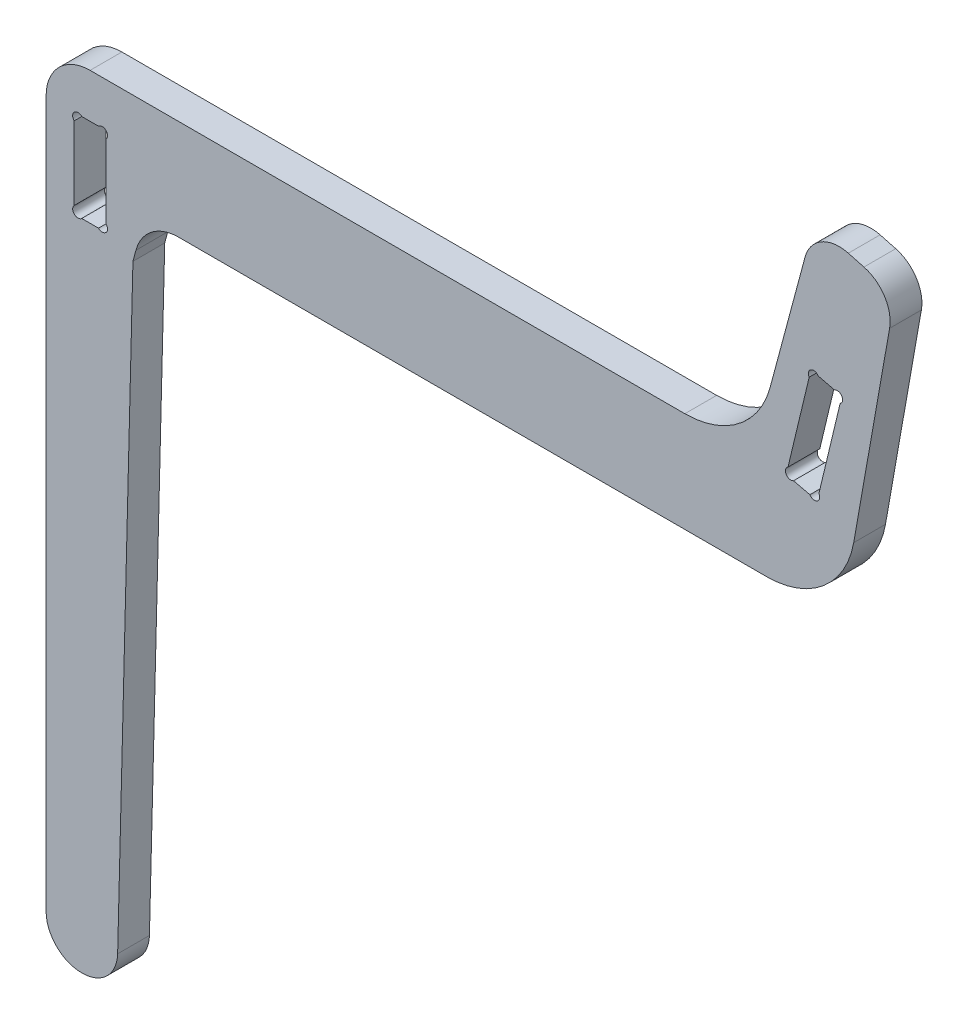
from build123d import *

# Parameters (mm, degrees)
BOSS_EXTRU_1_DEPTH      = 18
CONG_1_R                = 20
ESQUISSE2_W             = 18
ESQUISSE2_H             = 50
ENL_V_MAT_EXTRU_1_DEPTH = 621.180033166
ESQUISSE3_R             = 3
ENL_V_MAT_EXTRU_2_DEPTH = 18
ESQUISSE4_R             = 3
ENL_V_MAT_EXTRU_3_DEPTH = 621.180033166


with BuildPart() as part:
    # Esquisse1 → Boss.-Extru.1 (new body)
    with BuildSketch(Plane.XY):
        with BuildLine():
            ThreePointArc((50.847914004, -25.211594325), (59.741023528, -11.900328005), (74.9, -6.75419933))
            Line((74.9, -6.75419933), (407.994327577, -6.75419933))
            ThreePointArc((407.994327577, -6.75419933), (440.133708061, 4.943578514), (457.234715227, 34.563391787))
            Line((457.234715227, 34.563391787), (477.55938187, 149.83030421))
            ThreePointArc((477.55938187, 149.83030421), (474.731055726, 164.04925993), (463.039607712, 172.621784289))
            Line((463.039607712, 172.621784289), (454.196815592, 174.991203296))
            ThreePointArc((454.196815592, 174.991203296), (439.02043469, 172.993194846), (429.701918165, 160.849067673))
            Line((429.701918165, 160.849067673), (409.929941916, 87.059047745))
            ThreePointArc((409.929941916, 87.059047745), (392.071722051, 60.332332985), (361.633650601, 50))
            Line((361.633650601, 50), (24.9, 50))
            ThreePointArc((24.9, 50), (7.293041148, 42.706958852), (0, 25.1))
            Line((0, 25.1), (0, 0))
            Line((0, 0), (0, -25.1))
            Line((0, -25.1), (0, -394.9))
            Line((0, -394.9), (40, -394.9))
            Line((40, -394.9), (49.152085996, -31.542605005))
            Line((49.152085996, -31.542605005), (50.847914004, -25.211594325))
        make_face()
        Polygon((419.052037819, 48.890873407), (433.026376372, 107.240833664), (435.089359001, 106.746766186), (437.15234163, 106.252698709), (450.531364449, 103.048532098), (436.557025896, 44.698571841), align=None, mode=Mode.SUBTRACT)
    extrude(amount=BOSS_EXTRU_1_DEPTH)

    # Cong_1
    cong_1_edges = [part.edges().sort_by_distance(p)[0] for p in [
        (40, -394.9, 9),
        (0, -394.9, 9),
    ]]
    fillet(cong_1_edges, radius=CONG_1_R)

    # Esquisse2 → Enl_v. mat.-Extru.1 (cut, through all)
    with BuildSketch(Plane.XY.offset(18)):
        with Locations((24.9, 0)):
            Rectangle(ESQUISSE2_W, ESQUISSE2_H)
    extrude(amount=-ENL_V_MAT_EXTRU_1_DEPTH, mode=Mode.SUBTRACT)

    # Esquisse3 → Enl_v. mat.-Extru.2 (cut)
    with BuildSketch(Plane.XY.offset(18)):
        with Locations((18.021320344, 22.878679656)):
            Circle(ESQUISSE3_R)
        with Locations((31.778679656, -22.878679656)):
            Circle(ESQUISSE3_R)
        with Locations((31.778679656, 22.878679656)):
            Circle(ESQUISSE3_R)
        with Locations((18.021320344, -22.878679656)):
            Circle(ESQUISSE3_R)
    extrude(amount=-ENL_V_MAT_EXTRU_2_DEPTH, mode=Mode.SUBTRACT)

    # Esquisse4 → Enl_v. mat.-Extru.3 (cut, through all)
    with BuildSketch(Plane.XY.offset(18)):
        with Locations((434.595291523, 104.683783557)):
            Circle(ESQUISSE4_R)
        with Locations((434.988110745, 47.255621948)):
            Circle(ESQUISSE4_R)
        with Locations((447.974314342, 101.479616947)):
            Circle(ESQUISSE4_R)
        with Locations((421.609087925, 50.459788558)):
            Circle(ESQUISSE4_R)
    extrude(amount=-ENL_V_MAT_EXTRU_3_DEPTH, mode=Mode.SUBTRACT)


solid = part.part
